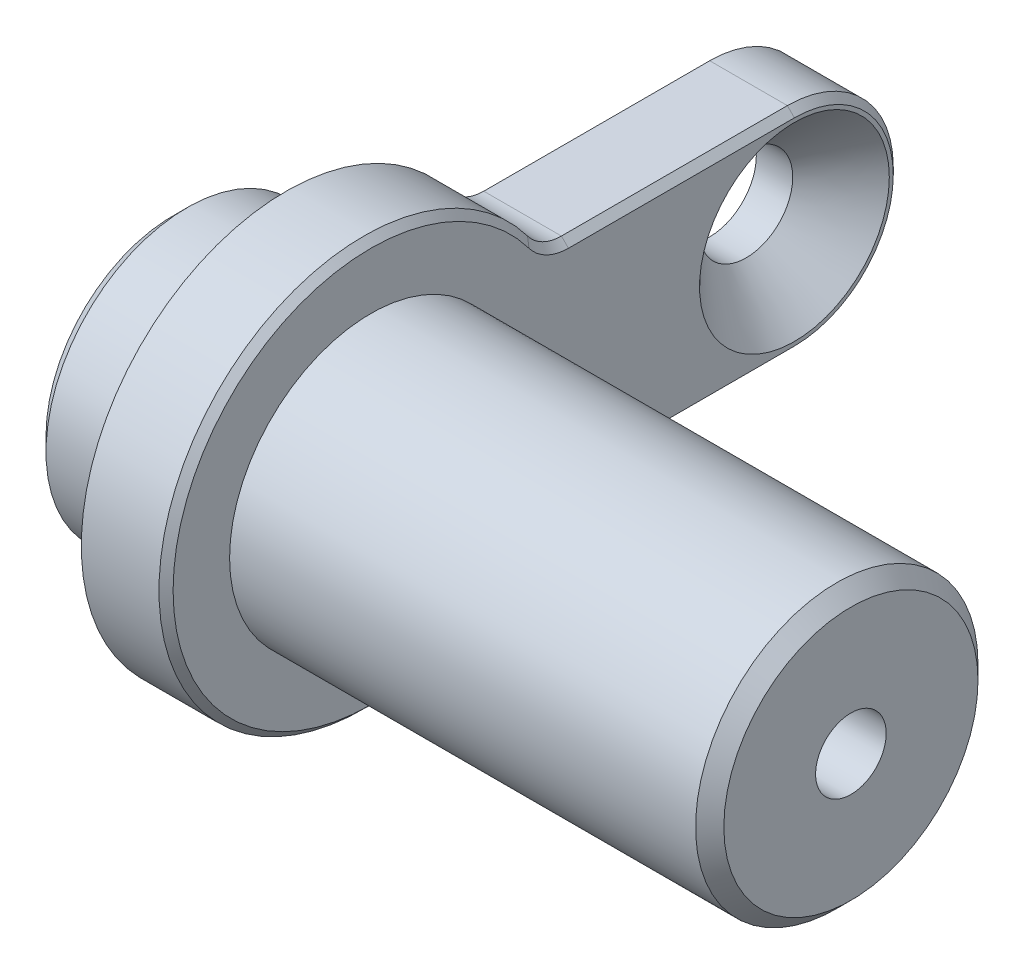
ISO-10303-21;
HEADER;
FILE_DESCRIPTION(('STEP AP214'),'2;1');
FILE_NAME('part.step','',(''),(''),'','','');
FILE_SCHEMA(('AUTOMOTIVE_DESIGN { 1 0 10303 214 1 1 1 1 }'));
ENDSEC;
DATA;
#1=APPLICATION_CONTEXT('core data for automotive mechanical design processes');
#2=APPLICATION_PROTOCOL_DEFINITION('international standard','automotive_design',2000,#1);
#3=PRODUCT_CONTEXT('',#1,'mechanical');
#4=PRODUCT('Part','Part','',(#3));
#5=PRODUCT_RELATED_PRODUCT_CATEGORY('part','',(#4));
#6=PRODUCT_DEFINITION_FORMATION('','',#4);
#7=PRODUCT_DEFINITION_CONTEXT('part definition',#1,'design');
#8=PRODUCT_DEFINITION('design','',#6,#7);
#9=PRODUCT_DEFINITION_SHAPE('','',#8);
#10=(LENGTH_UNIT() NAMED_UNIT(*) SI_UNIT(.MILLI.,.METRE.));
#11=(NAMED_UNIT(*) PLANE_ANGLE_UNIT() SI_UNIT($,.RADIAN.));
#12=(NAMED_UNIT(*) SI_UNIT($,.STERADIAN.) SOLID_ANGLE_UNIT());
#13=UNCERTAINTY_MEASURE_WITH_UNIT(LENGTH_MEASURE(1.E-05),#10,'distance_accuracy_value','');
#14=(GEOMETRIC_REPRESENTATION_CONTEXT(3) GLOBAL_UNCERTAINTY_ASSIGNED_CONTEXT((#13)) GLOBAL_UNIT_ASSIGNED_CONTEXT((#10,
#11,#12)) REPRESENTATION_CONTEXT('',''));
#15=CARTESIAN_POINT('',(0.,0.,0.));
#16=DIRECTION('',(0.,0.,1.));
#17=DIRECTION('',(1.,0.,0.));
#18=AXIS2_PLACEMENT_3D('',#15,#16,#17);
#19=CARTESIAN_POINT('',(-8.00000000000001,0.,0.));
#20=DIRECTION('',(1.,0.,0.));
#21=DIRECTION('',(0.,0.,-1.));
#22=AXIS2_PLACEMENT_3D('',#19,#20,#21);
#23=CYLINDRICAL_SURFACE('',#22,10.);
#24=CARTESIAN_POINT('',(39.,0.,0.));
#25=DIRECTION('',(1.,0.,0.));
#26=DIRECTION('',(0.,0.,-1.));
#27=AXIS2_PLACEMENT_3D('',#24,#25,#26);
#28=CIRCLE('',#27,10.);
#29=CARTESIAN_POINT('',(39.,0.,-10.));
#30=VERTEX_POINT('',#29);
#31=EDGE_CURVE('E11',#30,#30,#28,.F.);
#32=ORIENTED_EDGE('',*,*,#31,.T.);
#33=EDGE_LOOP('',(#32));
#34=FACE_BOUND('',#33,.T.);
#35=CARTESIAN_POINT('',(6.00000000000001,0.,0.));
#36=DIRECTION('',(-1.,0.,0.));
#37=DIRECTION('',(0.,0.,1.));
#38=AXIS2_PLACEMENT_3D('',#35,#36,#37);
#39=CIRCLE('',#38,10.);
#40=CARTESIAN_POINT('',(6.00000000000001,0.,10.));
#41=VERTEX_POINT('',#40);
#42=EDGE_CURVE('E163',#41,#41,#39,.F.);
#43=ORIENTED_EDGE('',*,*,#42,.T.);
#44=EDGE_LOOP('',(#43));
#45=FACE_BOUND('',#44,.T.);
#46=ADVANCED_FACE('F40',(#34,#45),#23,.T.);
#47=CARTESIAN_POINT('',(40.,0.,0.));
#48=DIRECTION('',(1.,0.,0.));
#49=DIRECTION('',(0.,0.,-1.));
#50=AXIS2_PLACEMENT_3D('',#47,#48,#49);
#51=PLANE('',#50);
#52=CARTESIAN_POINT('',(40.,0.,0.));
#53=DIRECTION('',(1.,0.,0.));
#54=DIRECTION('',(0.,0.,-1.));
#55=AXIS2_PLACEMENT_3D('',#52,#53,#54);
#56=CIRCLE('',#55,2.49999999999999);
#57=CARTESIAN_POINT('',(40.,0.,-2.49999999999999));
#58=VERTEX_POINT('',#57);
#59=EDGE_CURVE('E127',#58,#58,#56,.T.);
#60=ORIENTED_EDGE('',*,*,#59,.F.);
#61=EDGE_LOOP('',(#60));
#62=FACE_BOUND('',#61,.T.);
#63=CARTESIAN_POINT('',(40.,0.,0.));
#64=DIRECTION('',(1.,0.,0.));
#65=DIRECTION('',(0.,0.,-1.));
#66=AXIS2_PLACEMENT_3D('',#63,#64,#65);
#67=CIRCLE('',#66,8.99999999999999);
#68=CARTESIAN_POINT('',(40.,0.,-9.));
#69=VERTEX_POINT('',#68);
#70=EDGE_CURVE('E48',#69,#69,#67,.T.);
#71=ORIENTED_EDGE('',*,*,#70,.T.);
#72=EDGE_LOOP('',(#71));
#73=FACE_BOUND('',#72,.T.);
#74=ADVANCED_FACE('F230',(#62,#73),#51,.T.);
#75=CARTESIAN_POINT('',(6.00000000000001,0.,-30.));
#76=DIRECTION('',(-1.,0.,0.));
#77=DIRECTION('',(0.,0.,1.));
#78=AXIS2_PLACEMENT_3D('',#75,#76,#77);
#79=CYLINDRICAL_SURFACE('',#78,7.5);
#80=DIRECTION('',(-1.,0.,0.));
#81=VECTOR('',#80,1.);
#82=CARTESIAN_POINT('',(5.99999999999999,7.5,-30.));
#83=LINE('',#82,#81);
#84=CARTESIAN_POINT('',(5.49999999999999,7.5,-30.));
#85=VERTEX_POINT('',#84);
#86=CARTESIAN_POINT('',(0.,7.5,-30.));
#87=VERTEX_POINT('',#86);
#88=EDGE_CURVE('E161',#85,#87,#83,.T.);
#89=ORIENTED_EDGE('',*,*,#88,.F.);
#90=CARTESIAN_POINT('',(5.50000000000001,0.,-30.));
#91=DIRECTION('',(-1.,0.,0.));
#92=DIRECTION('',(0.,0.,1.));
#93=AXIS2_PLACEMENT_3D('',#90,#91,#92);
#94=CIRCLE('',#93,7.5);
#95=CARTESIAN_POINT('',(5.49999999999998,-7.50000000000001,-30.));
#96=VERTEX_POINT('',#95);
#97=EDGE_CURVE('E203',#85,#96,#94,.T.);
#98=ORIENTED_EDGE('',*,*,#97,.T.);
#99=DIRECTION('',(-1.,0.,0.));
#100=VECTOR('',#99,1.);
#101=CARTESIAN_POINT('',(5.99999999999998,-7.50000000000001,-30.));
#102=LINE('',#101,#100);
#103=CARTESIAN_POINT('',(0.,-7.50000000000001,-30.));
#104=VERTEX_POINT('',#103);
#105=EDGE_CURVE('E159',#96,#104,#102,.T.);
#106=ORIENTED_EDGE('',*,*,#105,.T.);
#107=CARTESIAN_POINT('',(0.,0.,-30.));
#108=DIRECTION('',(1.,0.,0.));
#109=DIRECTION('',(0.,0.,1.));
#110=AXIS2_PLACEMENT_3D('',#107,#108,#109);
#111=CIRCLE('',#110,7.5);
#112=EDGE_CURVE('E147',#104,#87,#111,.T.);
#113=ORIENTED_EDGE('',*,*,#112,.T.);
#114=EDGE_LOOP('',(#89,#98,#106,#113));
#115=FACE_BOUND('',#114,.T.);
#116=ADVANCED_FACE('F253',(#115),#79,.T.);
#117=CARTESIAN_POINT('',(5.99999999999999,7.50000000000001,-12.4096736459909));
#118=DIRECTION('',(0.,-1.,0.));
#119=DIRECTION('',(0.,0.,-1.));
#120=AXIS2_PLACEMENT_3D('',#117,#118,#119);
#121=PLANE('',#120);
#122=DIRECTION('',(1.,0.,0.));
#123=VECTOR('',#122,1.);
#124=CARTESIAN_POINT('',(5.99999999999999,7.50000000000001,-14.));
#125=LINE('',#124,#123);
#126=CARTESIAN_POINT('',(0.,7.50000000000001,-14.));
#127=VERTEX_POINT('',#126);
#128=CARTESIAN_POINT('',(5.49999999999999,7.50000000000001,-14.));
#129=VERTEX_POINT('',#128);
#130=EDGE_CURVE('E175',#127,#129,#125,.T.);
#131=ORIENTED_EDGE('',*,*,#130,.T.);
#132=DIRECTION('',(0.,0.,-1.));
#133=VECTOR('',#132,1.);
#134=CARTESIAN_POINT('',(5.49999999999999,7.50000000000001,-12.4096736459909));
#135=LINE('',#134,#133);
#136=EDGE_CURVE('E206',#129,#85,#135,.T.);
#137=ORIENTED_EDGE('',*,*,#136,.T.);
#138=ORIENTED_EDGE('',*,*,#88,.T.);
#139=DIRECTION('',(0.,0.,1.));
#140=VECTOR('',#139,1.);
#141=CARTESIAN_POINT('',(0.,7.50000000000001,-12.4096736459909));
#142=LINE('',#141,#140);
#143=EDGE_CURVE('E150',#87,#127,#142,.T.);
#144=ORIENTED_EDGE('',*,*,#143,.T.);
#145=EDGE_LOOP('',(#131,#137,#138,#144));
#146=FACE_BOUND('',#145,.T.);
#147=ADVANCED_FACE('F301',(#146),#121,.F.);
#148=CARTESIAN_POINT('',(6.00000000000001,0.,0.));
#149=DIRECTION('',(-1.,0.,0.));
#150=DIRECTION('',(0.,0.,1.));
#151=AXIS2_PLACEMENT_3D('',#148,#149,#150);
#152=CYLINDRICAL_SURFACE('',#151,14.5);
#153=DIRECTION('',(-1.,0.,0.));
#154=VECTOR('',#153,1.);
#155=CARTESIAN_POINT('',(5.99999999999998,-8.70000000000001,-11.6));
#156=LINE('',#155,#154);
#157=CARTESIAN_POINT('',(0.,-8.70000000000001,-11.6));
#158=VERTEX_POINT('',#157);
#159=CARTESIAN_POINT('',(5.49999999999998,-8.70000000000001,-11.6));
#160=VERTEX_POINT('',#159);
#161=EDGE_CURVE('E167',#158,#160,#156,.F.);
#162=ORIENTED_EDGE('',*,*,#161,.T.);
#163=CARTESIAN_POINT('',(5.50000000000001,0.,0.));
#164=DIRECTION('',(-1.,0.,0.));
#165=DIRECTION('',(0.,0.,1.));
#166=AXIS2_PLACEMENT_3D('',#163,#164,#165);
#167=CIRCLE('',#166,14.5);
#168=CARTESIAN_POINT('',(5.49999999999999,8.70000000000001,-11.6));
#169=VERTEX_POINT('',#168);
#170=EDGE_CURVE('E62',#160,#169,#167,.T.);
#171=ORIENTED_EDGE('',*,*,#170,.T.);
#172=DIRECTION('',(-1.,0.,0.));
#173=VECTOR('',#172,1.);
#174=CARTESIAN_POINT('',(5.99999999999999,8.70000000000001,-11.6));
#175=LINE('',#174,#173);
#176=CARTESIAN_POINT('',(0.,8.70000000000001,-11.6));
#177=VERTEX_POINT('',#176);
#178=EDGE_CURVE('E173',#169,#177,#175,.T.);
#179=ORIENTED_EDGE('',*,*,#178,.T.);
#180=CARTESIAN_POINT('',(0.,0.,0.));
#181=DIRECTION('',(1.,0.,0.));
#182=DIRECTION('',(0.,0.,-1.));
#183=AXIS2_PLACEMENT_3D('',#180,#181,#182);
#184=CIRCLE('',#183,14.5);
#185=EDGE_CURVE('E153',#177,#158,#184,.T.);
#186=ORIENTED_EDGE('',*,*,#185,.T.);
#187=EDGE_LOOP('',(#162,#171,#179,#186));
#188=FACE_BOUND('',#187,.T.);
#189=ADVANCED_FACE('F294',(#188),#152,.T.);
#190=CARTESIAN_POINT('',(5.99999999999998,-7.49999999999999,-12.4096736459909));
#191=DIRECTION('',(0.,1.,0.));
#192=DIRECTION('',(0.,0.,1.));
#193=AXIS2_PLACEMENT_3D('',#190,#191,#192);
#194=PLANE('',#193);
#195=ORIENTED_EDGE('',*,*,#105,.F.);
#196=DIRECTION('',(0.,0.,1.));
#197=VECTOR('',#196,1.);
#198=CARTESIAN_POINT('',(5.49999999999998,-7.49999999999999,-12.4096736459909));
#199=LINE('',#198,#197);
#200=CARTESIAN_POINT('',(5.49999999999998,-7.50000000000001,-14.));
#201=VERTEX_POINT('',#200);
#202=EDGE_CURVE('E208',#96,#201,#199,.T.);
#203=ORIENTED_EDGE('',*,*,#202,.T.);
#204=DIRECTION('',(1.,0.,0.));
#205=VECTOR('',#204,1.);
#206=CARTESIAN_POINT('',(0.,-7.50000000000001,-14.));
#207=LINE('',#206,#205);
#208=CARTESIAN_POINT('',(0.,-7.50000000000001,-14.));
#209=VERTEX_POINT('',#208);
#210=EDGE_CURVE('E178',#201,#209,#207,.F.);
#211=ORIENTED_EDGE('',*,*,#210,.T.);
#212=DIRECTION('',(0.,0.,-1.));
#213=VECTOR('',#212,1.);
#214=CARTESIAN_POINT('',(0.,-7.49999999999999,-12.4096736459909));
#215=LINE('',#214,#213);
#216=EDGE_CURVE('E156',#209,#104,#215,.T.);
#217=ORIENTED_EDGE('',*,*,#216,.T.);
#218=EDGE_LOOP('',(#195,#203,#211,#217));
#219=FACE_BOUND('',#218,.T.);
#220=ADVANCED_FACE('F289',(#219),#194,.F.);
#221=CARTESIAN_POINT('',(6.00000000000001,0.,-30.));
#222=DIRECTION('',(-1.,0.,0.));
#223=DIRECTION('',(0.,0.,1.));
#224=AXIS2_PLACEMENT_3D('',#221,#222,#223);
#225=PLANE('',#224);
#226=DIRECTION('',(0.,0.,-1.));
#227=VECTOR('',#226,1.);
#228=CARTESIAN_POINT('',(5.99999999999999,-7.00000000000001,-30.));
#229=LINE('',#228,#227);
#230=CARTESIAN_POINT('',(5.99999999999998,-7.,-14.));
#231=VERTEX_POINT('',#230);
#232=CARTESIAN_POINT('',(5.99999999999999,-7.00000000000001,-30.));
#233=VERTEX_POINT('',#232);
#234=EDGE_CURVE('E196',#231,#233,#229,.T.);
#235=ORIENTED_EDGE('',*,*,#234,.T.);
#236=CARTESIAN_POINT('',(6.00000000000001,0.,-30.));
#237=DIRECTION('',(-1.,0.,0.));
#238=DIRECTION('',(0.,0.,1.));
#239=AXIS2_PLACEMENT_3D('',#236,#237,#238);
#240=CIRCLE('',#239,7.);
#241=CARTESIAN_POINT('',(6.00000000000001,6.99999999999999,-30.));
#242=VERTEX_POINT('',#241);
#243=EDGE_CURVE('E200',#233,#242,#240,.F.);
#244=ORIENTED_EDGE('',*,*,#243,.T.);
#245=DIRECTION('',(0.,0.,1.));
#246=VECTOR('',#245,1.);
#247=CARTESIAN_POINT('',(6.00000000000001,6.99999999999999,-30.));
#248=LINE('',#247,#246);
#249=CARTESIAN_POINT('',(5.99999999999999,7.00000000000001,-14.));
#250=VERTEX_POINT('',#249);
#251=EDGE_CURVE('E198',#242,#250,#248,.T.);
#252=ORIENTED_EDGE('',*,*,#251,.T.);
#253=CARTESIAN_POINT('',(5.99999999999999,10.5,-14.));
#254=DIRECTION('',(-1.,0.,0.));
#255=DIRECTION('',(0.,0.,1.));
#256=AXIS2_PLACEMENT_3D('',#253,#254,#255);
#257=CIRCLE('',#256,3.5);
#258=CARTESIAN_POINT('',(6.00000000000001,8.4,-11.2));
#259=VERTEX_POINT('',#258);
#260=EDGE_CURVE('E194',#250,#259,#257,.T.);
#261=ORIENTED_EDGE('',*,*,#260,.T.);
#262=CARTESIAN_POINT('',(6.00000000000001,0.,0.));
#263=DIRECTION('',(-1.,0.,0.));
#264=DIRECTION('',(0.,0.,1.));
#265=AXIS2_PLACEMENT_3D('',#262,#263,#264);
#266=CIRCLE('',#265,14.);
#267=CARTESIAN_POINT('',(5.99999999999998,-8.4,-11.2));
#268=VERTEX_POINT('',#267);
#269=EDGE_CURVE('E190',#259,#268,#266,.F.);
#270=ORIENTED_EDGE('',*,*,#269,.T.);
#271=CARTESIAN_POINT('',(5.99999999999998,-10.5,-14.));
#272=DIRECTION('',(-1.,0.,0.));
#273=DIRECTION('',(0.,0.,1.));
#274=AXIS2_PLACEMENT_3D('',#271,#272,#273);
#275=CIRCLE('',#274,3.5);
#276=EDGE_CURVE('E192',#268,#231,#275,.T.);
#277=ORIENTED_EDGE('',*,*,#276,.T.);
#278=EDGE_LOOP('',(#235,#244,#252,#261,#270,#277));
#279=FACE_BOUND('',#278,.T.);
#280=CARTESIAN_POINT('',(6.00000000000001,0.,-30.));
#281=DIRECTION('',(1.,0.,0.));
#282=DIRECTION('',(0.,0.,-1.));
#283=AXIS2_PLACEMENT_3D('',#280,#281,#282);
#284=CIRCLE('',#283,6.72);
#285=CARTESIAN_POINT('',(6.00000000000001,0.,-36.72));
#286=VERTEX_POINT('',#285);
#287=EDGE_CURVE('E139',#286,#286,#284,.T.);
#288=ORIENTED_EDGE('',*,*,#287,.F.);
#289=EDGE_LOOP('',(#288));
#290=FACE_BOUND('',#289,.T.);
#291=ORIENTED_EDGE('',*,*,#42,.F.);
#292=EDGE_LOOP('',(#291));
#293=FACE_BOUND('',#292,.T.);
#294=ADVANCED_FACE('F278',(#279,#290,#293),#225,.F.);
#295=CARTESIAN_POINT('',(0.,0.,-30.));
#296=DIRECTION('',(-1.,0.,0.));
#297=DIRECTION('',(0.,0.,1.));
#298=AXIS2_PLACEMENT_3D('',#295,#296,#297);
#299=PLANE('',#298);
#300=CARTESIAN_POINT('',(0.,0.,-30.));
#301=DIRECTION('',(-1.,0.,0.));
#302=DIRECTION('',(0.,0.,1.));
#303=AXIS2_PLACEMENT_3D('',#300,#301,#302);
#304=CIRCLE('',#303,3.3);
#305=CARTESIAN_POINT('',(0.,0.,-26.7));
#306=VERTEX_POINT('',#305);
#307=EDGE_CURVE('E146',#306,#306,#304,.T.);
#308=ORIENTED_EDGE('',*,*,#307,.F.);
#309=EDGE_LOOP('',(#308));
#310=FACE_BOUND('',#309,.T.);
#311=CARTESIAN_POINT('',(0.,0.,0.));
#312=DIRECTION('',(-1.,0.,0.));
#313=DIRECTION('',(0.,0.,1.));
#314=AXIS2_PLACEMENT_3D('',#311,#312,#313);
#315=CIRCLE('',#314,10.);
#316=CARTESIAN_POINT('',(0.,0.,10.));
#317=VERTEX_POINT('',#316);
#318=EDGE_CURVE('E164',#317,#317,#315,.F.);
#319=ORIENTED_EDGE('',*,*,#318,.T.);
#320=EDGE_LOOP('',(#319));
#321=FACE_BOUND('',#320,.T.);
#322=ORIENTED_EDGE('',*,*,#112,.F.);
#323=ORIENTED_EDGE('',*,*,#216,.F.);
#324=CARTESIAN_POINT('',(0.,-10.5,-14.));
#325=DIRECTION('',(-1.,0.,0.));
#326=DIRECTION('',(0.,0.,1.));
#327=AXIS2_PLACEMENT_3D('',#324,#325,#326);
#328=CIRCLE('',#327,3.);
#329=EDGE_CURVE('E182',#209,#158,#328,.F.);
#330=ORIENTED_EDGE('',*,*,#329,.T.);
#331=ORIENTED_EDGE('',*,*,#185,.F.);
#332=CARTESIAN_POINT('',(0.,10.5,-14.));
#333=DIRECTION('',(-1.,0.,0.));
#334=DIRECTION('',(0.,0.,1.));
#335=AXIS2_PLACEMENT_3D('',#332,#333,#334);
#336=CIRCLE('',#335,3.);
#337=EDGE_CURVE('E180',#177,#127,#336,.F.);
#338=ORIENTED_EDGE('',*,*,#337,.T.);
#339=ORIENTED_EDGE('',*,*,#143,.F.);
#340=EDGE_LOOP('',(#322,#323,#330,#331,#338,#339));
#341=FACE_BOUND('',#340,.T.);
#342=ADVANCED_FACE('F270',(#310,#321,#341),#299,.T.);
#343=CARTESIAN_POINT('',(-8.00000000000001,0.,0.));
#344=DIRECTION('',(1.,0.,0.));
#345=DIRECTION('',(0.,0.,-1.));
#346=AXIS2_PLACEMENT_3D('',#343,#344,#345);
#347=PLANE('',#346);
#348=CARTESIAN_POINT('',(-8.00000000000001,0.,0.));
#349=DIRECTION('',(-1.,0.,0.));
#350=DIRECTION('',(0.,0.,1.));
#351=AXIS2_PLACEMENT_3D('',#348,#349,#350);
#352=CIRCLE('',#351,3.4);
#353=CARTESIAN_POINT('',(-8.00000000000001,0.,3.4));
#354=VERTEX_POINT('',#353);
#355=EDGE_CURVE('E128',#354,#354,#352,.T.);
#356=ORIENTED_EDGE('',*,*,#355,.F.);
#357=EDGE_LOOP('',(#356));
#358=FACE_BOUND('',#357,.T.);
#359=CARTESIAN_POINT('',(-8.00000000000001,0.,0.));
#360=DIRECTION('',(1.,0.,0.));
#361=DIRECTION('',(0.,0.,-1.));
#362=AXIS2_PLACEMENT_3D('',#359,#360,#361);
#363=CIRCLE('',#362,8.99999999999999);
#364=CARTESIAN_POINT('',(-8.00000000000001,0.,-8.99999999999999));
#365=VERTEX_POINT('',#364);
#366=EDGE_CURVE('E187',#365,#365,#363,.F.);
#367=ORIENTED_EDGE('',*,*,#366,.T.);
#368=EDGE_LOOP('',(#367));
#369=FACE_BOUND('',#368,.T.);
#370=ADVANCED_FACE('F261',(#358,#369),#347,.F.);
#371=CARTESIAN_POINT('',(-6.99999999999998,0.,0.));
#372=DIRECTION('',(1.,0.,0.));
#373=DIRECTION('',(0.,0.,-1.));
#374=AXIS2_PLACEMENT_3D('',#371,#372,#373);
#375=CIRCLE('',#374,10.);
#376=CARTESIAN_POINT('',(-6.99999999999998,0.,-10.));
#377=VERTEX_POINT('',#376);
#378=EDGE_CURVE('E184',#377,#377,#375,.T.);
#379=ORIENTED_EDGE('',*,*,#378,.T.);
#380=EDGE_LOOP('',(#379));
#381=FACE_BOUND('',#380,.T.);
#382=ORIENTED_EDGE('',*,*,#318,.F.);
#383=EDGE_LOOP('',(#382));
#384=FACE_BOUND('',#383,.T.);
#385=ADVANCED_FACE('F249',(#381,#384),#23,.T.);
#386=CARTESIAN_POINT('',(6.00000000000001,0.,-30.));
#387=DIRECTION('',(1.,0.,0.));
#388=DIRECTION('',(0.,0.,-1.));
#389=AXIS2_PLACEMENT_3D('',#386,#387,#388);
#390=CYLINDRICAL_SURFACE('',#389,3.3);
#391=ORIENTED_EDGE('',*,*,#307,.T.);
#392=EDGE_LOOP('',(#391));
#393=FACE_BOUND('',#392,.T.);
#394=CARTESIAN_POINT('',(2.58,0.,-30.));
#395=DIRECTION('',(1.,0.,0.));
#396=DIRECTION('',(0.,0.,-1.));
#397=AXIS2_PLACEMENT_3D('',#394,#395,#396);
#398=CIRCLE('',#397,3.3);
#399=CARTESIAN_POINT('',(2.58,0.,-33.3));
#400=VERTEX_POINT('',#399);
#401=EDGE_CURVE('E142',#400,#400,#398,.T.);
#402=ORIENTED_EDGE('',*,*,#401,.T.);
#403=EDGE_LOOP('',(#402));
#404=FACE_BOUND('',#403,.T.);
#405=ADVANCED_FACE('F260',(#393,#404),#390,.F.);
#406=CARTESIAN_POINT('',(6.00000000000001,0.,-30.));
#407=DIRECTION('',(1.,0.,0.));
#408=DIRECTION('',(0.,0.,-1.));
#409=AXIS2_PLACEMENT_3D('',#406,#407,#408);
#410=CONICAL_SURFACE('',#409,6.72,0.785398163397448);
#411=ORIENTED_EDGE('',*,*,#401,.F.);
#412=EDGE_LOOP('',(#411));
#413=FACE_BOUND('',#412,.T.);
#414=ORIENTED_EDGE('',*,*,#287,.T.);
#415=EDGE_LOOP('',(#414));
#416=FACE_BOUND('',#415,.T.);
#417=ADVANCED_FACE('F267',(#413,#416),#410,.F.);
#418=CARTESIAN_POINT('',(5.99999999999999,10.5,-14.));
#419=DIRECTION('',(-1.,0.,0.));
#420=DIRECTION('',(0.,0.,1.));
#421=AXIS2_PLACEMENT_3D('',#418,#419,#420);
#422=CYLINDRICAL_SURFACE('',#421,3.);
#423=ORIENTED_EDGE('',*,*,#178,.F.);
#424=CARTESIAN_POINT('',(5.49999999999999,10.5,-14.));
#425=DIRECTION('',(-1.,0.,0.));
#426=DIRECTION('',(0.,0.,1.));
#427=AXIS2_PLACEMENT_3D('',#424,#425,#426);
#428=CIRCLE('',#427,3.);
#429=EDGE_CURVE('E210',#169,#129,#428,.F.);
#430=ORIENTED_EDGE('',*,*,#429,.T.);
#431=ORIENTED_EDGE('',*,*,#130,.F.);
#432=ORIENTED_EDGE('',*,*,#337,.F.);
#433=EDGE_LOOP('',(#423,#430,#431,#432));
#434=FACE_BOUND('',#433,.T.);
#435=ADVANCED_FACE('F299',(#434),#422,.F.);
#436=CARTESIAN_POINT('',(5.99999999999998,-10.5,-14.));
#437=DIRECTION('',(-1.,0.,0.));
#438=DIRECTION('',(0.,0.,1.));
#439=AXIS2_PLACEMENT_3D('',#436,#437,#438);
#440=CYLINDRICAL_SURFACE('',#439,3.);
#441=ORIENTED_EDGE('',*,*,#210,.F.);
#442=CARTESIAN_POINT('',(5.49999999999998,-10.5,-14.));
#443=DIRECTION('',(-1.,0.,0.));
#444=DIRECTION('',(0.,0.,1.));
#445=AXIS2_PLACEMENT_3D('',#442,#443,#444);
#446=CIRCLE('',#445,3.);
#447=EDGE_CURVE('E55',#201,#160,#446,.F.);
#448=ORIENTED_EDGE('',*,*,#447,.T.);
#449=ORIENTED_EDGE('',*,*,#161,.F.);
#450=ORIENTED_EDGE('',*,*,#329,.F.);
#451=EDGE_LOOP('',(#441,#448,#449,#450));
#452=FACE_BOUND('',#451,.T.);
#453=ADVANCED_FACE('F292',(#452),#440,.F.);
#454=CARTESIAN_POINT('',(-6.99999999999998,0.,0.));
#455=DIRECTION('',(1.,0.,0.));
#456=DIRECTION('',(0.,0.,-1.));
#457=AXIS2_PLACEMENT_3D('',#454,#455,#456);
#458=CONICAL_SURFACE('',#457,10.,0.785398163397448);
#459=ORIENTED_EDGE('',*,*,#366,.F.);
#460=EDGE_LOOP('',(#459));
#461=FACE_BOUND('',#460,.T.);
#462=ORIENTED_EDGE('',*,*,#378,.F.);
#463=EDGE_LOOP('',(#462));
#464=FACE_BOUND('',#463,.T.);
#465=ADVANCED_FACE('F406',(#461,#464),#458,.T.);
#466=CARTESIAN_POINT('',(6.00000000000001,0.,0.));
#467=DIRECTION('',(-1.,0.,0.));
#468=DIRECTION('',(0.,0.,1.));
#469=AXIS2_PLACEMENT_3D('',#466,#467,#468);
#470=CONICAL_SURFACE('',#469,14.,0.785398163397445);
#471=DIRECTION('',(0.707106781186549,-0.424264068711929,0.565685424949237));
#472=VECTOR('',#471,1.);
#473=CARTESIAN_POINT('',(5.49999999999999,8.70000000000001,-11.6));
#474=LINE('',#473,#472);
#475=EDGE_CURVE('E223',#169,#259,#474,.T.);
#476=ORIENTED_EDGE('',*,*,#475,.F.);
#477=ORIENTED_EDGE('',*,*,#170,.F.);
#478=DIRECTION('',(-0.707106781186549,-0.424264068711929,-0.565685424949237));
#479=VECTOR('',#478,1.);
#480=CARTESIAN_POINT('',(5.99999999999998,-8.4,-11.2));
#481=LINE('',#480,#479);
#482=EDGE_CURVE('E143',#268,#160,#481,.T.);
#483=ORIENTED_EDGE('',*,*,#482,.F.);
#484=ORIENTED_EDGE('',*,*,#269,.F.);
#485=EDGE_LOOP('',(#476,#477,#483,#484));
#486=FACE_BOUND('',#485,.T.);
#487=ADVANCED_FACE('F319',(#486),#470,.T.);
#488=CARTESIAN_POINT('',(5.99999999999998,-10.5,-14.));
#489=DIRECTION('',(1.,0.,0.));
#490=DIRECTION('',(0.,0.,-1.));
#491=AXIS2_PLACEMENT_3D('',#488,#489,#490);
#492=CONICAL_SURFACE('',#491,3.5,0.785398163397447);
#493=ORIENTED_EDGE('',*,*,#482,.T.);
#494=ORIENTED_EDGE('',*,*,#447,.F.);
#495=DIRECTION('',(-0.707106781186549,-0.707106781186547,0.));
#496=VECTOR('',#495,1.);
#497=CARTESIAN_POINT('',(5.99999999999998,-7.,-14.));
#498=LINE('',#497,#496);
#499=EDGE_CURVE('E220',#231,#201,#498,.T.);
#500=ORIENTED_EDGE('',*,*,#499,.F.);
#501=ORIENTED_EDGE('',*,*,#276,.F.);
#502=EDGE_LOOP('',(#493,#494,#500,#501));
#503=FACE_BOUND('',#502,.T.);
#504=ADVANCED_FACE('F315',(#503),#492,.F.);
#505=CARTESIAN_POINT('',(5.99999999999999,10.5,-14.));
#506=DIRECTION('',(1.,0.,0.));
#507=DIRECTION('',(0.,0.,-1.));
#508=AXIS2_PLACEMENT_3D('',#505,#506,#507);
#509=CONICAL_SURFACE('',#508,3.5,0.785398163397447);
#510=ORIENTED_EDGE('',*,*,#475,.T.);
#511=ORIENTED_EDGE('',*,*,#260,.F.);
#512=DIRECTION('',(0.707106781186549,-0.707106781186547,0.));
#513=VECTOR('',#512,1.);
#514=CARTESIAN_POINT('',(5.49999999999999,7.50000000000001,-14.));
#515=LINE('',#514,#513);
#516=EDGE_CURVE('E217',#129,#250,#515,.T.);
#517=ORIENTED_EDGE('',*,*,#516,.F.);
#518=ORIENTED_EDGE('',*,*,#429,.F.);
#519=EDGE_LOOP('',(#510,#511,#517,#518));
#520=FACE_BOUND('',#519,.T.);
#521=ADVANCED_FACE('F323',(#520),#509,.F.);
#522=CARTESIAN_POINT('',(5.99999999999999,-7.00000000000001,-30.));
#523=DIRECTION('',(-0.707106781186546,0.707106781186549,0.));
#524=DIRECTION('',(0.,0.,-1.));
#525=AXIS2_PLACEMENT_3D('',#522,#523,#524);
#526=PLANE('',#525);
#527=ORIENTED_EDGE('',*,*,#499,.T.);
#528=ORIENTED_EDGE('',*,*,#202,.F.);
#529=DIRECTION('',(-0.707106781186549,-0.707106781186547,0.));
#530=VECTOR('',#529,1.);
#531=CARTESIAN_POINT('',(5.99999999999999,-7.00000000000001,-30.));
#532=LINE('',#531,#530);
#533=EDGE_CURVE('E215',#233,#96,#532,.T.);
#534=ORIENTED_EDGE('',*,*,#533,.F.);
#535=ORIENTED_EDGE('',*,*,#234,.F.);
#536=EDGE_LOOP('',(#527,#528,#534,#535));
#537=FACE_BOUND('',#536,.T.);
#538=ADVANCED_FACE('F311',(#537),#526,.F.);
#539=CARTESIAN_POINT('',(6.00000000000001,6.99999999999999,-30.));
#540=DIRECTION('',(-0.707106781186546,-0.707106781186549,0.));
#541=DIRECTION('',(0.,0.,1.));
#542=AXIS2_PLACEMENT_3D('',#539,#540,#541);
#543=PLANE('',#542);
#544=ORIENTED_EDGE('',*,*,#516,.T.);
#545=ORIENTED_EDGE('',*,*,#251,.F.);
#546=DIRECTION('',(0.707106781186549,-0.707106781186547,0.));
#547=VECTOR('',#546,1.);
#548=CARTESIAN_POINT('',(5.49999999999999,7.5,-30.));
#549=LINE('',#548,#547);
#550=EDGE_CURVE('E138',#85,#242,#549,.T.);
#551=ORIENTED_EDGE('',*,*,#550,.F.);
#552=ORIENTED_EDGE('',*,*,#136,.F.);
#553=EDGE_LOOP('',(#544,#545,#551,#552));
#554=FACE_BOUND('',#553,.T.);
#555=ADVANCED_FACE('F242',(#554),#543,.F.);
#556=CARTESIAN_POINT('',(6.00000000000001,0.,-30.));
#557=DIRECTION('',(-1.,0.,0.));
#558=DIRECTION('',(0.,0.,1.));
#559=AXIS2_PLACEMENT_3D('',#556,#557,#558);
#560=CONICAL_SURFACE('',#559,7.,0.785398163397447);
#561=ORIENTED_EDGE('',*,*,#533,.T.);
#562=ORIENTED_EDGE('',*,*,#97,.F.);
#563=ORIENTED_EDGE('',*,*,#550,.T.);
#564=ORIENTED_EDGE('',*,*,#243,.F.);
#565=EDGE_LOOP('',(#561,#562,#563,#564));
#566=FACE_BOUND('',#565,.T.);
#567=ADVANCED_FACE('F234',(#566),#560,.T.);
#568=CARTESIAN_POINT('',(40.,0.,0.));
#569=DIRECTION('',(-1.,0.,0.));
#570=DIRECTION('',(0.,0.,1.));
#571=AXIS2_PLACEMENT_3D('',#568,#569,#570);
#572=CONICAL_SURFACE('',#571,8.99999999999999,0.785398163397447);
#573=ORIENTED_EDGE('',*,*,#31,.F.);
#574=EDGE_LOOP('',(#573));
#575=FACE_BOUND('',#574,.T.);
#576=ORIENTED_EDGE('',*,*,#70,.F.);
#577=EDGE_LOOP('',(#576));
#578=FACE_BOUND('',#577,.T.);
#579=ADVANCED_FACE('F42',(#575,#578),#572,.T.);
#580=CARTESIAN_POINT('',(23.,0.,0.));
#581=DIRECTION('',(1.,0.,0.));
#582=DIRECTION('',(0.,0.,-1.));
#583=AXIS2_PLACEMENT_3D('',#580,#581,#582);
#584=CONICAL_SURFACE('',#583,2.49999999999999,1.02974425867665);
#585=CARTESIAN_POINT('',(21.4978484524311,0.,0.));
#586=VERTEX_POINT('',#585);
#587=VERTEX_LOOP('',#586);
#588=FACE_BOUND('',#587,.T.);
#589=CARTESIAN_POINT('',(23.,0.,0.));
#590=DIRECTION('',(1.,0.,0.));
#591=DIRECTION('',(0.,0.,-1.));
#592=AXIS2_PLACEMENT_3D('',#589,#590,#591);
#593=CIRCLE('',#592,2.49999999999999);
#594=CARTESIAN_POINT('',(23.,0.,-2.49999999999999));
#595=VERTEX_POINT('',#594);
#596=EDGE_CURVE('E131',#595,#595,#593,.T.);
#597=ORIENTED_EDGE('',*,*,#596,.T.);
#598=EDGE_LOOP('',(#597));
#599=FACE_BOUND('',#598,.T.);
#600=ADVANCED_FACE('F233',(#588,#599),#584,.F.);
#601=CARTESIAN_POINT('',(40.,0.,0.));
#602=DIRECTION('',(1.,0.,0.));
#603=DIRECTION('',(0.,0.,-1.));
#604=AXIS2_PLACEMENT_3D('',#601,#602,#603);
#605=CYLINDRICAL_SURFACE('',#604,2.49999999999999);
#606=ORIENTED_EDGE('',*,*,#596,.F.);
#607=EDGE_LOOP('',(#606));
#608=FACE_BOUND('',#607,.T.);
#609=ORIENTED_EDGE('',*,*,#59,.T.);
#610=EDGE_LOOP('',(#609));
#611=FACE_BOUND('',#610,.T.);
#612=ADVANCED_FACE('F121',(#608,#611),#605,.F.);
#613=CARTESIAN_POINT('',(14.25,0.,0.));
#614=DIRECTION('',(-1.,0.,0.));
#615=DIRECTION('',(0.,0.,1.));
#616=AXIS2_PLACEMENT_3D('',#613,#614,#615);
#617=CONICAL_SURFACE('',#616,3.4,1.02974425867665);
#618=CARTESIAN_POINT('',(16.2929261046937,0.,0.));
#619=VERTEX_POINT('',#618);
#620=VERTEX_LOOP('',#619);
#621=FACE_BOUND('',#620,.T.);
#622=CARTESIAN_POINT('',(14.25,0.,0.));
#623=DIRECTION('',(-1.,0.,0.));
#624=DIRECTION('',(0.,0.,1.));
#625=AXIS2_PLACEMENT_3D('',#622,#623,#624);
#626=CIRCLE('',#625,3.4);
#627=CARTESIAN_POINT('',(14.25,0.,3.4));
#628=VERTEX_POINT('',#627);
#629=EDGE_CURVE('E125',#628,#628,#626,.T.);
#630=ORIENTED_EDGE('',*,*,#629,.T.);
#631=EDGE_LOOP('',(#630));
#632=FACE_BOUND('',#631,.T.);
#633=ADVANCED_FACE('F117',(#621,#632),#617,.F.);
#634=CARTESIAN_POINT('',(-8.00000000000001,0.,0.));
#635=DIRECTION('',(-1.,0.,0.));
#636=DIRECTION('',(0.,0.,1.));
#637=AXIS2_PLACEMENT_3D('',#634,#635,#636);
#638=CYLINDRICAL_SURFACE('',#637,3.4);
#639=ORIENTED_EDGE('',*,*,#629,.F.);
#640=EDGE_LOOP('',(#639));
#641=FACE_BOUND('',#640,.T.);
#642=ORIENTED_EDGE('',*,*,#355,.T.);
#643=EDGE_LOOP('',(#642));
#644=FACE_BOUND('',#643,.T.);
#645=ADVANCED_FACE('F120',(#641,#644),#638,.F.);
#646=CLOSED_SHELL('',(#46,#74,#116,#147,#189,#220,#294,#342,#370,#385,#405,#417,#435,#453,#465,
#487,#504,#521,#538,#555,#567,#579,#600,#612,#633,#645));
#647=MANIFOLD_SOLID_BREP('B2',#646);
#648=ADVANCED_BREP_SHAPE_REPRESENTATION('',(#18,#647),#14);
#649=SHAPE_DEFINITION_REPRESENTATION(#9,#648);
ENDSEC;
END-ISO-10303-21;
